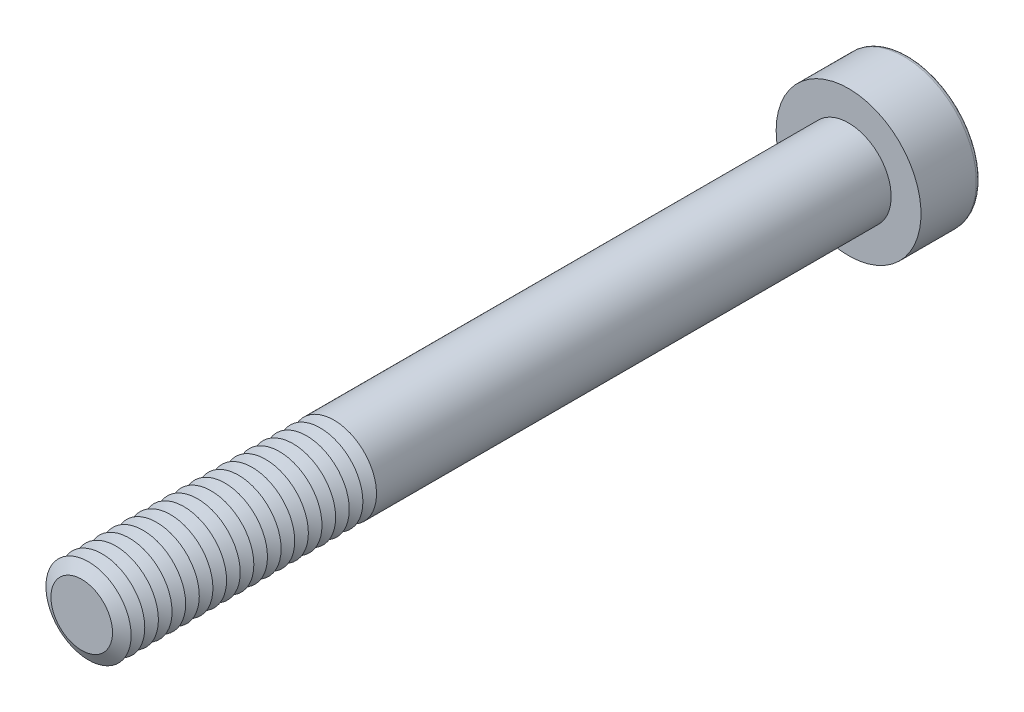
from build123d import *

# Parameters (mm, degrees)
SKETCH1_R           = 2.5
BOSS_EXTRUDE1_DEPTH = 45
SKETCH2_R           = 4.25
BOSS_EXTRUDE2_DEPTH = 3.5
CUT_EXTRUDE1_DEPTH  = 2.25
FILLET1_R           = 0.25
LPATTERN1_COUNT     = 19
LPATTERN1_PITCH     = 0.8


with BuildPart() as part:
    # Sketch1 → Boss-Extrude1 (new body)
    with BuildSketch(Plane.XY):
        with Locations(Location((0, 0, 0), (0, 0, 180))):
            Circle(SKETCH1_R)
    extrude(amount=BOSS_EXTRUDE1_DEPTH)

    # Sketch2 → Boss-Extrude2 (add)
    with BuildSketch(Plane(origin=(0, 0, 0), x_dir=(-1, 0, 0), z_dir=(0, 0, -1))):
        Circle(SKETCH2_R)
    extrude(amount=BOSS_EXTRUDE2_DEPTH)

    # Sketch3 → Cut-Extrude1 (cut)
    with BuildSketch(Plane(origin=(0, 0, -3.5), x_dir=(-1, 0, 0), z_dir=(0, 0, -1))):
        Polygon((-0.866025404, 1.5), (-1.732050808, 0), (-0.866025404, -1.5), (0.866025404, -1.5), (1.732050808, 0), (0.866025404, 1.5), align=None)
    extrude(amount=-CUT_EXTRUDE1_DEPTH, mode=Mode.SUBTRACT)

    # Fillet1
    fillet1_edges = [part.edges().sort_by_distance(p)[0] for p in [
        (4.25, 0, -3.5),
    ]]
    fillet(fillet1_edges, radius=FILLET1_R)

    # Cut-Extrude2 cone 1 section (on through the dimple's axis) → Cut-Extrude2 (revolve, cut)
    with BuildSketch(Plane(origin=(0, 0, -1.25), x_dir=(0, 1, 0), z_dir=(1, 0, 0))):
        Polygon((0, 0), (1.5, 0), (0, 0.866025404), align=None)
    revolve(axis=Axis((0, 0, -1.25), (0, 0, 1)), mode=Mode.SUBTRACT)

    # Cut-Extrude3 cone 1 section (on through the dimple's axis) → Cut-Extrude3 (revolve, cut)
    with BuildSketch(Plane(origin=(0, 0, -3.5), x_dir=(0, 1, 0), z_dir=(1, 0, 0))):
        Polygon((0, 0), (1.732050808, 0), (0, 0.464101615), align=None)
    revolve(axis=Axis((0, 0, -3.5), (0, 0, 1)), mode=Mode.SUBTRACT)

    # Sketch7 → Cut-Revolve1 (revolve, cut)
    with BuildSketch(Plane(origin=(0, 0, 0), x_dir=(0, 0, -1), z_dir=(1, 0, 0)), mode=Mode.PRIVATE) as cut_revolve1_sk:
        Polygon((-45, 1.807179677), (-44.6, 2.5), (-45.4, 2.5), align=None)
    cut_revolve1 = revolve(cut_revolve1_sk.sketch.rotate(Axis((0, 0, 45), (0, 0, -1)), 270), axis=Axis((0, 0, 45), (0, 0, -1)), mode=Mode.SUBTRACT)

    # LPattern1: Cut-Revolve1 ×19
    with Locations(*[(0, 0, -i * LPATTERN1_PITCH) for i in range(1, LPATTERN1_COUNT)]):
        add(cut_revolve1, mode=Mode.SUBTRACT)


solid = part.part
